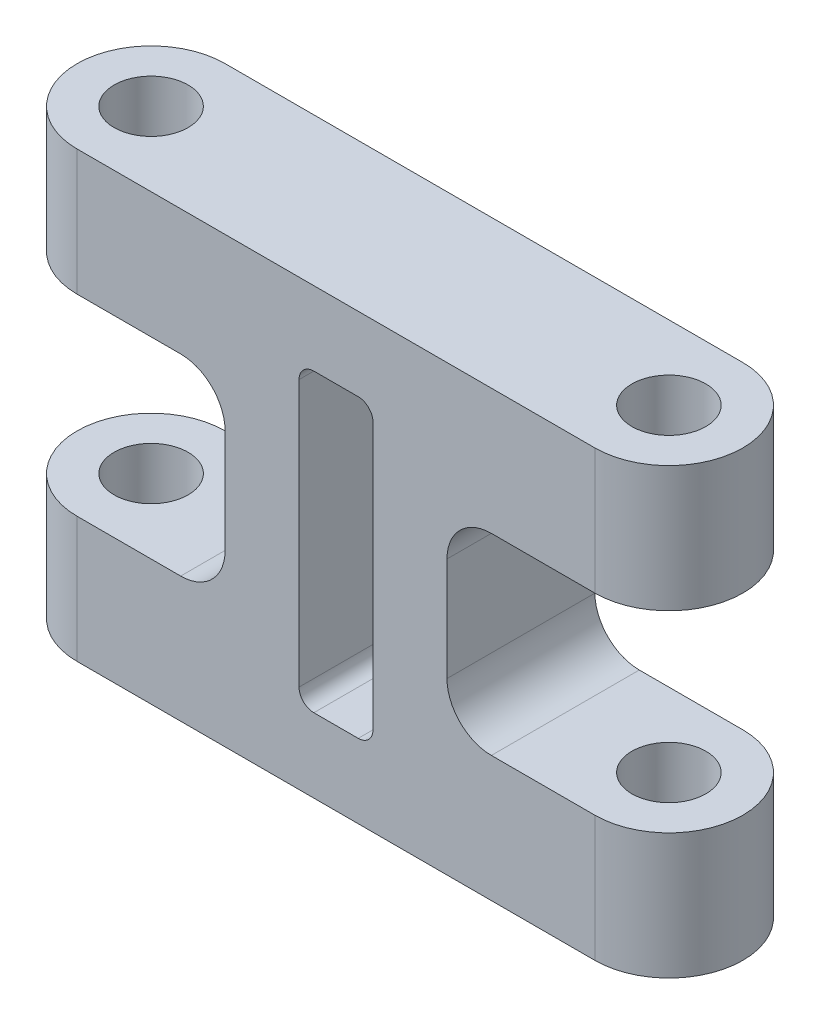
from build123d import *

# Parameters (mm, degrees)
SALIENTE_EXTRUIR1_DEPTH = 15
CROQUIS2_W              = 15
CROQUIS2_H              = 13
CORTAR_EXTRUIR1_DEPTH   = 29.831406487
CROQUIS3_R              = 2.5
CORTAR_EXTRUIR2_DEPTH   = 38.831864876
CROQUIS4_W              = 5
CROQUIS4_H              = 20
CORTAR_EXTRUIR3_DEPTH   = 29.831406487
REDONDEO1_R             = 1
REDONDEO2_R             = 3


with BuildPart() as part:
    # Croquis1 → Saliente-Extruir1 (new, symmetric)
    with BuildSketch(Plane(origin=(0, 0, 0), x_dir=(1, 0, 0), z_dir=(0, 1, 0))):
        with BuildLine():
            Line((-17.5, 5), (17.5, 5))
            ThreePointArc((17.5, 5), (22.5, 0), (17.5, -5))
            Line((17.5, -5), (-17.5, -5))
            ThreePointArc((-17.5, -5), (-22.5, 0), (-17.5, 5))
        make_face()
    extrude(amount=SALIENTE_EXTRUIR1_DEPTH, both=True)

    # Croquis2 → Cortar-Extruir1 (cut, through all)
    with BuildSketch(Plane(origin=(0, 0, -5), x_dir=(1, 0, 0), z_dir=(0, 0, -1))):
        with Locations((-15, 0)):
            Rectangle(CROQUIS2_W, CROQUIS2_H)
        with Locations((15, 0)):
            Rectangle(CROQUIS2_W, CROQUIS2_H)
    extrude(amount=-CORTAR_EXTRUIR1_DEPTH, mode=Mode.SUBTRACT)

    # Croquis3 → Cortar-Extruir2 (cut, through all)
    with BuildSketch(Plane(origin=(0, 15, 0), x_dir=(1, 0, 0), z_dir=(0, 1, 0))):
        with Locations(Location((-17.5, 0, 0), (0, 0, 270))):
            Circle(CROQUIS3_R)
        with Locations(Location((17.5, 0, 0), (0, 0, 270))):
            Circle(CROQUIS3_R)
    extrude(amount=-CORTAR_EXTRUIR2_DEPTH, mode=Mode.SUBTRACT)

    # Croquis4 → Cortar-Extruir3 (cut, through all)
    with BuildSketch(Plane.XY.offset(5)):
        Rectangle(CROQUIS4_W, CROQUIS4_H)
    extrude(amount=-CORTAR_EXTRUIR3_DEPTH, mode=Mode.SUBTRACT)

    # Redondeo1
    redondeo1_edges = [part.edges().sort_by_distance(p)[0] for p in [
        (2.5, 10, 0),
        (2.5, -10, 0),
        (-2.5, -10, 0),
        (-2.5, 10, 0),
    ]]
    fillet(redondeo1_edges, radius=REDONDEO1_R)

    # Redondeo2
    redondeo2_edges = [part.edges().sort_by_distance(p)[0] for p in [
        (-7.5, 6.5, 0),
        (-7.5, -6.5, 0),
        (7.5, -6.5, 0),
        (7.5, 6.5, 0),
    ]]
    fillet(redondeo2_edges, radius=REDONDEO2_R)


solid = part.part
